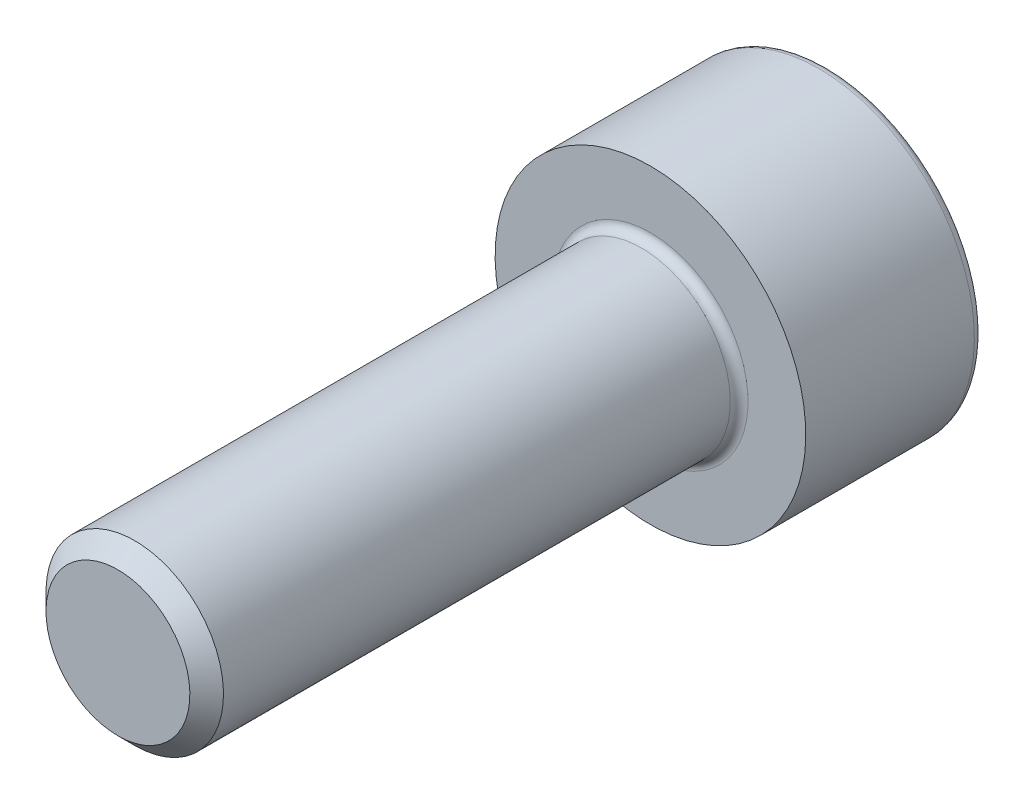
ISO-10303-21;
HEADER;
FILE_DESCRIPTION(('STEP AP214'),'2;1');
FILE_NAME('part.step','',(''),(''),'','','');
FILE_SCHEMA(('AUTOMOTIVE_DESIGN { 1 0 10303 214 1 1 1 1 }'));
ENDSEC;
DATA;
#1=APPLICATION_CONTEXT('core data for automotive mechanical design processes');
#2=APPLICATION_PROTOCOL_DEFINITION('international standard','automotive_design',2000,#1);
#3=PRODUCT_CONTEXT('',#1,'mechanical');
#4=PRODUCT('Part','Part','',(#3));
#5=PRODUCT_RELATED_PRODUCT_CATEGORY('part','',(#4));
#6=PRODUCT_DEFINITION_FORMATION('','',#4);
#7=PRODUCT_DEFINITION_CONTEXT('part definition',#1,'design');
#8=PRODUCT_DEFINITION('design','',#6,#7);
#9=PRODUCT_DEFINITION_SHAPE('','',#8);
#10=(LENGTH_UNIT() NAMED_UNIT(*) SI_UNIT(.MILLI.,.METRE.));
#11=(NAMED_UNIT(*) PLANE_ANGLE_UNIT() SI_UNIT($,.RADIAN.));
#12=(NAMED_UNIT(*) SI_UNIT($,.STERADIAN.) SOLID_ANGLE_UNIT());
#13=UNCERTAINTY_MEASURE_WITH_UNIT(LENGTH_MEASURE(1.E-05),#10,'distance_accuracy_value','');
#14=(GEOMETRIC_REPRESENTATION_CONTEXT(3) GLOBAL_UNCERTAINTY_ASSIGNED_CONTEXT((#13)) GLOBAL_UNIT_ASSIGNED_CONTEXT((#10,
#11,#12)) REPRESENTATION_CONTEXT('',''));
#15=CARTESIAN_POINT('',(0.,0.,0.));
#16=DIRECTION('',(0.,0.,1.));
#17=DIRECTION('',(1.,0.,0.));
#18=AXIS2_PLACEMENT_3D('',#15,#16,#17);
#19=CARTESIAN_POINT('',(0.,2.,12.));
#20=DIRECTION('',(0.,0.,1.));
#21=DIRECTION('',(0.,-1.,0.));
#22=AXIS2_PLACEMENT_3D('',#19,#20,#21);
#23=PLANE('',#22);
#24=CARTESIAN_POINT('',(0.,0.,12.));
#25=DIRECTION('',(0.,0.,1.));
#26=DIRECTION('',(0.,-1.,0.));
#27=AXIS2_PLACEMENT_3D('',#24,#25,#26);
#28=CIRCLE('',#27,1.621125);
#29=CARTESIAN_POINT('',(0.,-1.621125,12.));
#30=VERTEX_POINT('',#29);
#31=EDGE_CURVE('E11',#30,#30,#28,.T.);
#32=ORIENTED_EDGE('',*,*,#31,.T.);
#33=EDGE_LOOP('',(#32));
#34=FACE_BOUND('',#33,.T.);
#35=ADVANCED_FACE('F33',(#34),#23,.T.);
#36=CARTESIAN_POINT('',(0.,0.,-4.));
#37=DIRECTION('',(0.,0.,-1.));
#38=DIRECTION('',(0.,1.,0.));
#39=AXIS2_PLACEMENT_3D('',#36,#37,#38);
#40=CYLINDRICAL_SURFACE('',#39,2.);
#41=CARTESIAN_POINT('',(0.,0.,11.621125));
#42=DIRECTION('',(0.,0.,1.));
#43=DIRECTION('',(0.,-1.,0.));
#44=AXIS2_PLACEMENT_3D('',#41,#42,#43);
#45=CIRCLE('',#44,2.);
#46=CARTESIAN_POINT('',(0.,-2.,11.621125));
#47=VERTEX_POINT('',#46);
#48=EDGE_CURVE('E40',#47,#47,#45,.F.);
#49=ORIENTED_EDGE('',*,*,#48,.T.);
#50=EDGE_LOOP('',(#49));
#51=FACE_BOUND('',#50,.T.);
#52=CARTESIAN_POINT('',(0.,0.,0.2));
#53=DIRECTION('',(0.,0.,1.));
#54=DIRECTION('',(0.,-1.,0.));
#55=AXIS2_PLACEMENT_3D('',#52,#53,#54);
#56=CIRCLE('',#55,2.);
#57=CARTESIAN_POINT('',(0.,-2.,0.199999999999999));
#58=VERTEX_POINT('',#57);
#59=EDGE_CURVE('E183',#58,#58,#56,.T.);
#60=ORIENTED_EDGE('',*,*,#59,.T.);
#61=EDGE_LOOP('',(#60));
#62=FACE_BOUND('',#61,.T.);
#63=ADVANCED_FACE('F194',(#51,#62),#40,.T.);
#64=CARTESIAN_POINT('',(0.,3.5,0.));
#65=DIRECTION('',(0.,0.,1.));
#66=DIRECTION('',(0.,-1.,0.));
#67=AXIS2_PLACEMENT_3D('',#64,#65,#66);
#68=PLANE('',#67);
#69=CARTESIAN_POINT('',(0.,0.,0.));
#70=DIRECTION('',(0.,0.,1.));
#71=DIRECTION('',(0.,-1.,0.));
#72=AXIS2_PLACEMENT_3D('',#69,#70,#71);
#73=CIRCLE('',#72,2.2);
#74=CARTESIAN_POINT('',(0.,-2.2,0.));
#75=VERTEX_POINT('',#74);
#76=EDGE_CURVE('E180',#75,#75,#73,.F.);
#77=ORIENTED_EDGE('',*,*,#76,.T.);
#78=EDGE_LOOP('',(#77));
#79=FACE_BOUND('',#78,.T.);
#80=CARTESIAN_POINT('',(0.,0.,0.));
#81=DIRECTION('',(0.,0.,-1.));
#82=DIRECTION('',(0.,1.,0.));
#83=AXIS2_PLACEMENT_3D('',#80,#81,#82);
#84=CIRCLE('',#83,3.5);
#85=CARTESIAN_POINT('',(0.,3.5,0.));
#86=VERTEX_POINT('',#85);
#87=EDGE_CURVE('E176',#86,#86,#84,.T.);
#88=ORIENTED_EDGE('',*,*,#87,.F.);
#89=EDGE_LOOP('',(#88));
#90=FACE_BOUND('',#89,.T.);
#91=ADVANCED_FACE('F214',(#79,#90),#68,.T.);
#92=CARTESIAN_POINT('',(0.,0.,-4.));
#93=DIRECTION('',(0.,0.,-1.));
#94=DIRECTION('',(0.,1.,0.));
#95=AXIS2_PLACEMENT_3D('',#92,#93,#94);
#96=CYLINDRICAL_SURFACE('',#95,3.5);
#97=CARTESIAN_POINT('',(0.,0.,-3.8));
#98=DIRECTION('',(0.,0.,-1.));
#99=DIRECTION('',(0.,1.,0.));
#100=AXIS2_PLACEMENT_3D('',#97,#98,#99);
#101=CIRCLE('',#100,3.5);
#102=CARTESIAN_POINT('',(0.,3.5,-3.8));
#103=VERTEX_POINT('',#102);
#104=EDGE_CURVE('E189',#103,#103,#101,.F.);
#105=ORIENTED_EDGE('',*,*,#104,.T.);
#106=EDGE_LOOP('',(#105));
#107=FACE_BOUND('',#106,.T.);
#108=ORIENTED_EDGE('',*,*,#87,.T.);
#109=EDGE_LOOP('',(#108));
#110=FACE_BOUND('',#109,.T.);
#111=ADVANCED_FACE('F218',(#107,#110),#96,.T.);
#112=CARTESIAN_POINT('',(0.,0.,-4.));
#113=DIRECTION('',(0.,0.,-1.));
#114=DIRECTION('',(0.,1.,0.));
#115=AXIS2_PLACEMENT_3D('',#112,#113,#114);
#116=PLANE('',#115);
#117=CARTESIAN_POINT('',(0.,0.,-4.));
#118=DIRECTION('',(0.,0.,-1.));
#119=DIRECTION('',(0.,1.,0.));
#120=AXIS2_PLACEMENT_3D('',#117,#118,#119);
#121=CIRCLE('',#120,3.3);
#122=CARTESIAN_POINT('',(0.,3.3,-4.));
#123=VERTEX_POINT('',#122);
#124=EDGE_CURVE('E186',#123,#123,#121,.T.);
#125=ORIENTED_EDGE('',*,*,#124,.T.);
#126=EDGE_LOOP('',(#125));
#127=FACE_BOUND('',#126,.T.);
#128=DIRECTION('',(-1.,0.,0.));
#129=VECTOR('',#128,1.);
#130=CARTESIAN_POINT('',(0.866025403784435,-1.5,-4.));
#131=LINE('',#130,#129);
#132=CARTESIAN_POINT('',(0.866025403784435,-1.5,-4.));
#133=VERTEX_POINT('',#132);
#134=CARTESIAN_POINT('',(-0.86602540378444,-1.5,-4.));
#135=VERTEX_POINT('',#134);
#136=EDGE_CURVE('E138',#133,#135,#131,.T.);
#137=ORIENTED_EDGE('',*,*,#136,.F.);
#138=DIRECTION('',(-0.499999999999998,-0.86602540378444,0.));
#139=VECTOR('',#138,1.);
#140=CARTESIAN_POINT('',(1.73205080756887,0.,-4.));
#141=LINE('',#140,#139);
#142=CARTESIAN_POINT('',(1.73205080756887,0.,-4.));
#143=VERTEX_POINT('',#142);
#144=EDGE_CURVE('E133',#143,#133,#141,.T.);
#145=ORIENTED_EDGE('',*,*,#144,.F.);
#146=DIRECTION('',(0.499999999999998,-0.86602540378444,0.));
#147=VECTOR('',#146,1.);
#148=CARTESIAN_POINT('',(0.866025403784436,1.5,-4.));
#149=LINE('',#148,#147);
#150=CARTESIAN_POINT('',(0.866025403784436,1.5,-4.));
#151=VERTEX_POINT('',#150);
#152=EDGE_CURVE('E131',#151,#143,#149,.T.);
#153=ORIENTED_EDGE('',*,*,#152,.F.);
#154=DIRECTION('',(1.,0.,0.));
#155=VECTOR('',#154,1.);
#156=CARTESIAN_POINT('',(-0.866025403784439,1.5,-4.));
#157=LINE('',#156,#155);
#158=CARTESIAN_POINT('',(-0.866025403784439,1.5,-4.));
#159=VERTEX_POINT('',#158);
#160=EDGE_CURVE('E116',#159,#151,#157,.T.);
#161=ORIENTED_EDGE('',*,*,#160,.F.);
#162=DIRECTION('',(0.499999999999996,0.866025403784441,0.));
#163=VECTOR('',#162,1.);
#164=CARTESIAN_POINT('',(-1.73205080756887,0.,-4.));
#165=LINE('',#164,#163);
#166=CARTESIAN_POINT('',(-1.73205080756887,0.,-4.));
#167=VERTEX_POINT('',#166);
#168=EDGE_CURVE('E104',#167,#159,#165,.T.);
#169=ORIENTED_EDGE('',*,*,#168,.F.);
#170=DIRECTION('',(-0.499999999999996,0.866025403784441,0.));
#171=VECTOR('',#170,1.);
#172=CARTESIAN_POINT('',(-0.86602540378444,-1.5,-4.));
#173=LINE('',#172,#171);
#174=EDGE_CURVE('E140',#135,#167,#173,.T.);
#175=ORIENTED_EDGE('',*,*,#174,.F.);
#176=EDGE_LOOP('',(#137,#145,#153,#161,#169,#175));
#177=FACE_BOUND('',#176,.T.);
#178=ADVANCED_FACE('F129',(#127,#177),#116,.T.);
#179=CARTESIAN_POINT('',(-1.73205080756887,0.,-2.));
#180=DIRECTION('',(-0.866025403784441,0.499999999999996,0.));
#181=DIRECTION('',(-0.499999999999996,-0.866025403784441,0.));
#182=AXIS2_PLACEMENT_3D('',#179,#180,#181);
#183=PLANE('',#182);
#184=ORIENTED_EDGE('',*,*,#168,.T.);
#185=DIRECTION('',(0.,0.,-1.));
#186=VECTOR('',#185,1.);
#187=CARTESIAN_POINT('',(-0.866025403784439,1.5,-2.));
#188=LINE('',#187,#186);
#189=CARTESIAN_POINT('',(-0.866025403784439,1.5,-2.));
#190=VERTEX_POINT('',#189);
#191=EDGE_CURVE('E108',#190,#159,#188,.T.);
#192=ORIENTED_EDGE('',*,*,#191,.F.);
#193=DIRECTION('',(0.499999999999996,0.866025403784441,0.));
#194=VECTOR('',#193,1.);
#195=CARTESIAN_POINT('',(-1.73205080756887,0.,-2.));
#196=LINE('',#195,#194);
#197=CARTESIAN_POINT('',(-1.29903810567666,0.749999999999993,-2.));
#198=VERTEX_POINT('',#197);
#199=EDGE_CURVE('E142',#198,#190,#196,.T.);
#200=ORIENTED_EDGE('',*,*,#199,.F.);
#201=CARTESIAN_POINT('',(-1.73205080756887,0.,-2.));
#202=VERTEX_POINT('',#201);
#203=EDGE_CURVE('E143',#202,#198,#196,.T.);
#204=ORIENTED_EDGE('',*,*,#203,.F.);
#205=DIRECTION('',(0.,0.,-1.));
#206=VECTOR('',#205,1.);
#207=CARTESIAN_POINT('',(-1.73205080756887,0.,-2.));
#208=LINE('',#207,#206);
#209=EDGE_CURVE('E112',#202,#167,#208,.T.);
#210=ORIENTED_EDGE('',*,*,#209,.T.);
#211=EDGE_LOOP('',(#184,#192,#200,#204,#210));
#212=FACE_BOUND('',#211,.T.);
#213=ADVANCED_FACE('F106',(#212),#183,.F.);
#214=CARTESIAN_POINT('',(-0.86602540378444,-1.5,-2.));
#215=DIRECTION('',(-0.866025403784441,-0.499999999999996,0.));
#216=DIRECTION('',(0.499999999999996,-0.866025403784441,0.));
#217=AXIS2_PLACEMENT_3D('',#214,#215,#216);
#218=PLANE('',#217);
#219=ORIENTED_EDGE('',*,*,#174,.T.);
#220=ORIENTED_EDGE('',*,*,#209,.F.);
#221=DIRECTION('',(-0.499999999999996,0.866025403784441,0.));
#222=VECTOR('',#221,1.);
#223=CARTESIAN_POINT('',(-0.86602540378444,-1.5,-2.));
#224=LINE('',#223,#222);
#225=CARTESIAN_POINT('',(-1.29903810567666,-0.749999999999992,-2.));
#226=VERTEX_POINT('',#225);
#227=EDGE_CURVE('E158',#226,#202,#224,.T.);
#228=ORIENTED_EDGE('',*,*,#227,.F.);
#229=CARTESIAN_POINT('',(-0.86602540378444,-1.5,-2.));
#230=VERTEX_POINT('',#229);
#231=EDGE_CURVE('E126',#230,#226,#224,.T.);
#232=ORIENTED_EDGE('',*,*,#231,.F.);
#233=DIRECTION('',(0.,0.,-1.));
#234=VECTOR('',#233,1.);
#235=CARTESIAN_POINT('',(-0.86602540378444,-1.5,-2.));
#236=LINE('',#235,#234);
#237=EDGE_CURVE('E163',#230,#135,#236,.T.);
#238=ORIENTED_EDGE('',*,*,#237,.T.);
#239=EDGE_LOOP('',(#219,#220,#228,#232,#238));
#240=FACE_BOUND('',#239,.T.);
#241=ADVANCED_FACE('F234',(#240),#218,.F.);
#242=CARTESIAN_POINT('',(0.866025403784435,-1.5,-2.));
#243=DIRECTION('',(0.,-1.,0.));
#244=DIRECTION('',(0.,0.,-1.));
#245=AXIS2_PLACEMENT_3D('',#242,#243,#244);
#246=PLANE('',#245);
#247=ORIENTED_EDGE('',*,*,#136,.T.);
#248=ORIENTED_EDGE('',*,*,#237,.F.);
#249=DIRECTION('',(-1.,0.,0.));
#250=VECTOR('',#249,1.);
#251=CARTESIAN_POINT('',(0.866025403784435,-1.5,-2.));
#252=LINE('',#251,#250);
#253=CARTESIAN_POINT('',(0.,-1.5,-2.));
#254=VERTEX_POINT('',#253);
#255=EDGE_CURVE('E156',#254,#230,#252,.T.);
#256=ORIENTED_EDGE('',*,*,#255,.F.);
#257=CARTESIAN_POINT('',(0.866025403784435,-1.5,-2.));
#258=VERTEX_POINT('',#257);
#259=EDGE_CURVE('E47',#258,#254,#252,.T.);
#260=ORIENTED_EDGE('',*,*,#259,.F.);
#261=DIRECTION('',(0.,0.,-1.));
#262=VECTOR('',#261,1.);
#263=CARTESIAN_POINT('',(0.866025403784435,-1.5,-2.));
#264=LINE('',#263,#262);
#265=EDGE_CURVE('E166',#258,#133,#264,.T.);
#266=ORIENTED_EDGE('',*,*,#265,.T.);
#267=EDGE_LOOP('',(#247,#248,#256,#260,#266));
#268=FACE_BOUND('',#267,.T.);
#269=ADVANCED_FACE('F245',(#268),#246,.F.);
#270=CARTESIAN_POINT('',(1.73205080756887,0.,-2.));
#271=DIRECTION('',(0.86602540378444,-0.499999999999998,0.));
#272=DIRECTION('',(0.499999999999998,0.86602540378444,0.));
#273=AXIS2_PLACEMENT_3D('',#270,#271,#272);
#274=PLANE('',#273);
#275=ORIENTED_EDGE('',*,*,#144,.T.);
#276=ORIENTED_EDGE('',*,*,#265,.F.);
#277=DIRECTION('',(-0.499999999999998,-0.86602540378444,0.));
#278=VECTOR('',#277,1.);
#279=CARTESIAN_POINT('',(1.73205080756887,0.,-2.));
#280=LINE('',#279,#278);
#281=CARTESIAN_POINT('',(1.29903810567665,-0.749999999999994,-2.));
#282=VERTEX_POINT('',#281);
#283=EDGE_CURVE('E152',#282,#258,#280,.T.);
#284=ORIENTED_EDGE('',*,*,#283,.F.);
#285=CARTESIAN_POINT('',(1.73205080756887,0.,-2.));
#286=VERTEX_POINT('',#285);
#287=EDGE_CURVE('E153',#286,#282,#280,.T.);
#288=ORIENTED_EDGE('',*,*,#287,.F.);
#289=DIRECTION('',(0.,0.,-1.));
#290=VECTOR('',#289,1.);
#291=CARTESIAN_POINT('',(1.73205080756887,0.,-2.));
#292=LINE('',#291,#290);
#293=EDGE_CURVE('E169',#286,#143,#292,.T.);
#294=ORIENTED_EDGE('',*,*,#293,.T.);
#295=EDGE_LOOP('',(#275,#276,#284,#288,#294));
#296=FACE_BOUND('',#295,.T.);
#297=ADVANCED_FACE('F241',(#296),#274,.F.);
#298=CARTESIAN_POINT('',(0.866025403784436,1.5,-2.));
#299=DIRECTION('',(0.86602540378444,0.499999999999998,0.));
#300=DIRECTION('',(-0.499999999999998,0.86602540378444,0.));
#301=AXIS2_PLACEMENT_3D('',#298,#299,#300);
#302=PLANE('',#301);
#303=ORIENTED_EDGE('',*,*,#152,.T.);
#304=ORIENTED_EDGE('',*,*,#293,.F.);
#305=DIRECTION('',(0.499999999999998,-0.86602540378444,0.));
#306=VECTOR('',#305,1.);
#307=CARTESIAN_POINT('',(0.866025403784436,1.5,-2.));
#308=LINE('',#307,#306);
#309=CARTESIAN_POINT('',(1.29903810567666,0.749999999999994,-2.));
#310=VERTEX_POINT('',#309);
#311=EDGE_CURVE('E148',#310,#286,#308,.T.);
#312=ORIENTED_EDGE('',*,*,#311,.F.);
#313=CARTESIAN_POINT('',(0.866025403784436,1.5,-2.));
#314=VERTEX_POINT('',#313);
#315=EDGE_CURVE('E149',#314,#310,#308,.T.);
#316=ORIENTED_EDGE('',*,*,#315,.F.);
#317=DIRECTION('',(0.,0.,-1.));
#318=VECTOR('',#317,1.);
#319=CARTESIAN_POINT('',(0.866025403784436,1.5,-2.));
#320=LINE('',#319,#318);
#321=EDGE_CURVE('E125',#314,#151,#320,.T.);
#322=ORIENTED_EDGE('',*,*,#321,.T.);
#323=EDGE_LOOP('',(#303,#304,#312,#316,#322));
#324=FACE_BOUND('',#323,.T.);
#325=ADVANCED_FACE('F238',(#324),#302,.F.);
#326=CARTESIAN_POINT('',(-0.866025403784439,1.5,-2.));
#327=DIRECTION('',(0.,1.,0.));
#328=DIRECTION('',(0.,0.,1.));
#329=AXIS2_PLACEMENT_3D('',#326,#327,#328);
#330=PLANE('',#329);
#331=ORIENTED_EDGE('',*,*,#160,.T.);
#332=ORIENTED_EDGE('',*,*,#321,.F.);
#333=DIRECTION('',(1.,0.,0.));
#334=VECTOR('',#333,1.);
#335=CARTESIAN_POINT('',(-0.866025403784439,1.5,-2.));
#336=LINE('',#335,#334);
#337=CARTESIAN_POINT('',(0.,1.5,-2.));
#338=VERTEX_POINT('',#337);
#339=EDGE_CURVE('E146',#338,#314,#336,.T.);
#340=ORIENTED_EDGE('',*,*,#339,.F.);
#341=EDGE_CURVE('E124',#190,#338,#336,.T.);
#342=ORIENTED_EDGE('',*,*,#341,.F.);
#343=ORIENTED_EDGE('',*,*,#191,.T.);
#344=EDGE_LOOP('',(#331,#332,#340,#342,#343));
#345=FACE_BOUND('',#344,.T.);
#346=ADVANCED_FACE('F119',(#345),#330,.F.);
#347=CARTESIAN_POINT('',(-2.5980762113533,-1.5,-2.));
#348=DIRECTION('',(0.,0.,1.));
#349=DIRECTION('',(0.,-1.,0.));
#350=AXIS2_PLACEMENT_3D('',#347,#348,#349);
#351=PLANE('',#350);
#352=ORIENTED_EDGE('',*,*,#255,.T.);
#353=ORIENTED_EDGE('',*,*,#231,.T.);
#354=CARTESIAN_POINT('',(0.,0.,-2.));
#355=DIRECTION('',(0.,0.,-1.));
#356=DIRECTION('',(0.,1.,0.));
#357=AXIS2_PLACEMENT_3D('',#354,#355,#356);
#358=CIRCLE('',#357,1.5);
#359=EDGE_CURVE('E405',#254,#226,#358,.T.);
#360=ORIENTED_EDGE('',*,*,#359,.F.);
#361=EDGE_LOOP('',(#352,#353,#360));
#362=FACE_BOUND('',#361,.T.);
#363=ADVANCED_FACE('F237',(#362),#351,.F.);
#364=ORIENTED_EDGE('',*,*,#227,.T.);
#365=ORIENTED_EDGE('',*,*,#203,.T.);
#366=EDGE_CURVE('E401',#226,#198,#358,.T.);
#367=ORIENTED_EDGE('',*,*,#366,.F.);
#368=EDGE_LOOP('',(#364,#365,#367));
#369=FACE_BOUND('',#368,.T.);
#370=ADVANCED_FACE('F255',(#369),#351,.F.);
#371=ORIENTED_EDGE('',*,*,#199,.T.);
#372=ORIENTED_EDGE('',*,*,#341,.T.);
#373=EDGE_CURVE('E162',#198,#338,#358,.T.);
#374=ORIENTED_EDGE('',*,*,#373,.F.);
#375=EDGE_LOOP('',(#371,#372,#374));
#376=FACE_BOUND('',#375,.T.);
#377=ADVANCED_FACE('F304',(#376),#351,.F.);
#378=ORIENTED_EDGE('',*,*,#339,.T.);
#379=ORIENTED_EDGE('',*,*,#315,.T.);
#380=EDGE_CURVE('E173',#338,#310,#358,.T.);
#381=ORIENTED_EDGE('',*,*,#380,.F.);
#382=EDGE_LOOP('',(#378,#379,#381));
#383=FACE_BOUND('',#382,.T.);
#384=ADVANCED_FACE('F296',(#383),#351,.F.);
#385=ORIENTED_EDGE('',*,*,#311,.T.);
#386=ORIENTED_EDGE('',*,*,#287,.T.);
#387=EDGE_CURVE('E177',#310,#282,#358,.T.);
#388=ORIENTED_EDGE('',*,*,#387,.F.);
#389=EDGE_LOOP('',(#385,#386,#388));
#390=FACE_BOUND('',#389,.T.);
#391=ADVANCED_FACE('F289',(#390),#351,.F.);
#392=ORIENTED_EDGE('',*,*,#283,.T.);
#393=ORIENTED_EDGE('',*,*,#259,.T.);
#394=EDGE_CURVE('E407',#282,#254,#358,.T.);
#395=ORIENTED_EDGE('',*,*,#394,.F.);
#396=EDGE_LOOP('',(#392,#393,#395));
#397=FACE_BOUND('',#396,.T.);
#398=ADVANCED_FACE('F231',(#397),#351,.F.);
#399=CARTESIAN_POINT('',(0.,0.,-2.));
#400=DIRECTION('',(0.,0.,-1.));
#401=DIRECTION('',(0.,1.,0.));
#402=AXIS2_PLACEMENT_3D('',#399,#400,#401);
#403=CONICAL_SURFACE('',#402,1.5,1.0471975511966);
#404=CARTESIAN_POINT('',(0.,0.,-1.13397459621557));
#405=VERTEX_POINT('',#404);
#406=VERTEX_LOOP('',#405);
#407=FACE_BOUND('',#406,.T.);
#408=ORIENTED_EDGE('',*,*,#380,.T.);
#409=ORIENTED_EDGE('',*,*,#387,.T.);
#410=ORIENTED_EDGE('',*,*,#394,.T.);
#411=ORIENTED_EDGE('',*,*,#359,.T.);
#412=ORIENTED_EDGE('',*,*,#366,.T.);
#413=ORIENTED_EDGE('',*,*,#373,.T.);
#414=EDGE_LOOP('',(#408,#409,#410,#411,#412,#413));
#415=FACE_BOUND('',#414,.T.);
#416=ADVANCED_FACE('F228',(#407,#415),#403,.F.);
#417=CARTESIAN_POINT('',(0.,0.,0.2));
#418=DIRECTION('',(0.,0.,1.));
#419=DIRECTION('',(0.,-1.,0.));
#420=AXIS2_PLACEMENT_3D('',#417,#418,#419);
#421=TOROIDAL_SURFACE('',#420,2.2,0.2);
#422=ORIENTED_EDGE('',*,*,#59,.F.);
#423=EDGE_LOOP('',(#422));
#424=FACE_BOUND('',#423,.T.);
#425=ORIENTED_EDGE('',*,*,#76,.F.);
#426=EDGE_LOOP('',(#425));
#427=FACE_BOUND('',#426,.T.);
#428=ADVANCED_FACE('F205',(#424,#427),#421,.F.);
#429=CARTESIAN_POINT('',(0.,0.,-3.8));
#430=DIRECTION('',(0.,0.,-1.));
#431=DIRECTION('',(0.,1.,0.));
#432=AXIS2_PLACEMENT_3D('',#429,#430,#431);
#433=TOROIDAL_SURFACE('',#432,3.3,0.2);
#434=ORIENTED_EDGE('',*,*,#104,.F.);
#435=EDGE_LOOP('',(#434));
#436=FACE_BOUND('',#435,.T.);
#437=ORIENTED_EDGE('',*,*,#124,.F.);
#438=EDGE_LOOP('',(#437));
#439=FACE_BOUND('',#438,.T.);
#440=ADVANCED_FACE('F199',(#436,#439),#433,.T.);
#441=CARTESIAN_POINT('',(0.,0.,11.621125));
#442=DIRECTION('',(0.,0.,-1.));
#443=DIRECTION('',(0.,1.,0.));
#444=AXIS2_PLACEMENT_3D('',#441,#442,#443);
#445=CONICAL_SURFACE('',#444,2.,0.785398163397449);
#446=ORIENTED_EDGE('',*,*,#31,.F.);
#447=EDGE_LOOP('',(#446));
#448=FACE_BOUND('',#447,.T.);
#449=ORIENTED_EDGE('',*,*,#48,.F.);
#450=EDGE_LOOP('',(#449));
#451=FACE_BOUND('',#450,.T.);
#452=ADVANCED_FACE('F197',(#448,#451),#445,.T.);
#453=CLOSED_SHELL('',(#35,#63,#91,#111,#178,#213,#241,#269,#297,#325,#346,#363,#370,#377,#384,
#391,#398,#416,#428,#440,#452));
#454=MANIFOLD_SOLID_BREP('B2',#453);
#455=ADVANCED_BREP_SHAPE_REPRESENTATION('',(#18,#454),#14);
#456=SHAPE_DEFINITION_REPRESENTATION(#9,#455);
ENDSEC;
END-ISO-10303-21;
